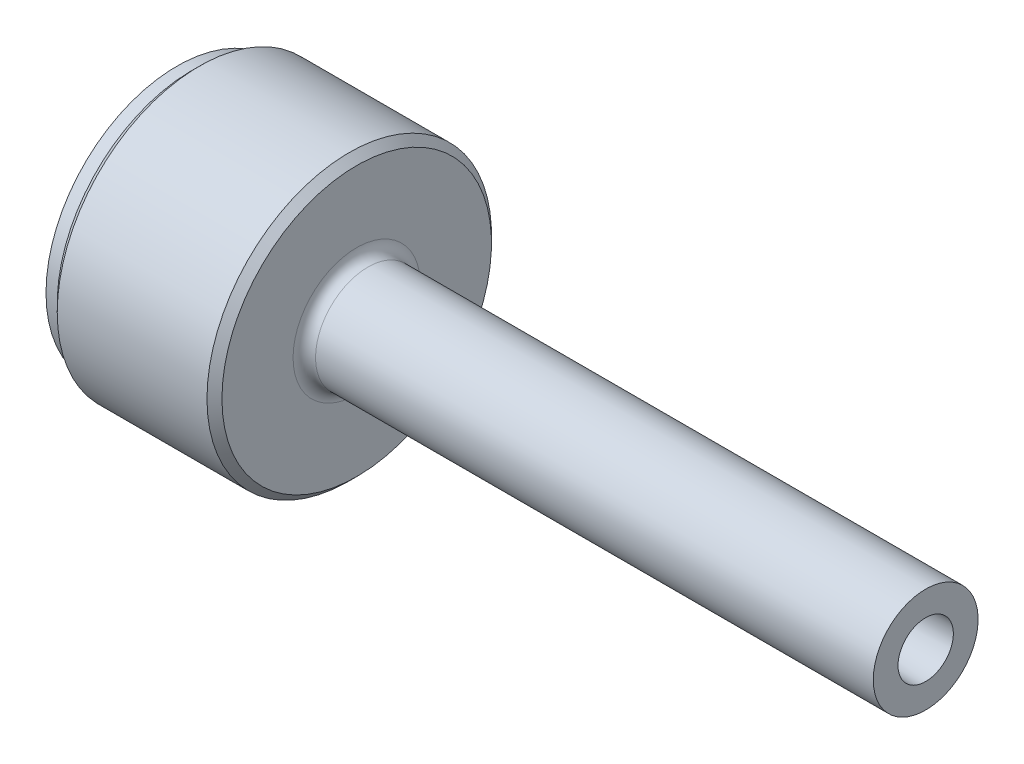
ISO-10303-21;
HEADER;
FILE_DESCRIPTION(('STEP AP214'),'2;1');
FILE_NAME('part.step','',(''),(''),'','','');
FILE_SCHEMA(('AUTOMOTIVE_DESIGN { 1 0 10303 214 1 1 1 1 }'));
ENDSEC;
DATA;
#1=APPLICATION_CONTEXT('core data for automotive mechanical design processes');
#2=APPLICATION_PROTOCOL_DEFINITION('international standard','automotive_design',2000,#1);
#3=PRODUCT_CONTEXT('',#1,'mechanical');
#4=PRODUCT('Part','Part','',(#3));
#5=PRODUCT_RELATED_PRODUCT_CATEGORY('part','',(#4));
#6=PRODUCT_DEFINITION_FORMATION('','',#4);
#7=PRODUCT_DEFINITION_CONTEXT('part definition',#1,'design');
#8=PRODUCT_DEFINITION('design','',#6,#7);
#9=PRODUCT_DEFINITION_SHAPE('','',#8);
#10=(LENGTH_UNIT() NAMED_UNIT(*) SI_UNIT(.MILLI.,.METRE.));
#11=(NAMED_UNIT(*) PLANE_ANGLE_UNIT() SI_UNIT($,.RADIAN.));
#12=(NAMED_UNIT(*) SI_UNIT($,.STERADIAN.) SOLID_ANGLE_UNIT());
#13=UNCERTAINTY_MEASURE_WITH_UNIT(LENGTH_MEASURE(1.E-05),#10,'distance_accuracy_value','');
#14=(GEOMETRIC_REPRESENTATION_CONTEXT(3) GLOBAL_UNCERTAINTY_ASSIGNED_CONTEXT((#13)) GLOBAL_UNIT_ASSIGNED_CONTEXT((#10,
#11,#12)) REPRESENTATION_CONTEXT('',''));
#15=CARTESIAN_POINT('',(0.,0.,0.));
#16=DIRECTION('',(0.,0.,1.));
#17=DIRECTION('',(1.,0.,0.));
#18=AXIS2_PLACEMENT_3D('',#15,#16,#17);
#19=CARTESIAN_POINT('',(100.,7.,0.));
#20=DIRECTION('',(-1.,0.,0.));
#21=DIRECTION('',(0.,0.,1.));
#22=AXIS2_PLACEMENT_3D('',#19,#20,#21);
#23=PLANE('',#22);
#24=CARTESIAN_POINT('',(100.,0.,0.));
#25=DIRECTION('',(-1.,0.,0.));
#26=DIRECTION('',(0.,0.,1.));
#27=AXIS2_PLACEMENT_3D('',#24,#25,#26);
#28=CIRCLE('',#27,7.);
#29=CARTESIAN_POINT('',(100.,0.,7.));
#30=VERTEX_POINT('',#29);
#31=EDGE_CURVE('E40',#30,#30,#28,.T.);
#32=ORIENTED_EDGE('',*,*,#31,.F.);
#33=EDGE_LOOP('',(#32));
#34=FACE_BOUND('',#33,.T.);
#35=CARTESIAN_POINT('',(100.,0.,0.));
#36=DIRECTION('',(-1.,0.,0.));
#37=DIRECTION('',(0.,0.,1.));
#38=AXIS2_PLACEMENT_3D('',#35,#36,#37);
#39=CIRCLE('',#38,3.69314129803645);
#40=CARTESIAN_POINT('',(100.,0.,3.69314129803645));
#41=VERTEX_POINT('',#40);
#42=EDGE_CURVE('E55',#41,#41,#39,.T.);
#43=ORIENTED_EDGE('',*,*,#42,.T.);
#44=EDGE_LOOP('',(#43));
#45=FACE_BOUND('',#44,.T.);
#46=ADVANCED_FACE('F14',(#34,#45),#23,.F.);
#47=CARTESIAN_POINT('',(0.,0.,0.));
#48=DIRECTION('',(-1.,0.,0.));
#49=DIRECTION('',(0.,0.,1.));
#50=AXIS2_PLACEMENT_3D('',#47,#48,#49);
#51=CYLINDRICAL_SURFACE('',#50,7.);
#52=CARTESIAN_POINT('',(25.5,0.,0.));
#53=DIRECTION('',(-1.,0.,0.));
#54=DIRECTION('',(0.,0.,1.));
#55=AXIS2_PLACEMENT_3D('',#52,#53,#54);
#56=CIRCLE('',#55,7.);
#57=CARTESIAN_POINT('',(25.5,0.,7.));
#58=VERTEX_POINT('',#57);
#59=EDGE_CURVE('E9',#58,#58,#56,.F.);
#60=ORIENTED_EDGE('',*,*,#59,.T.);
#61=EDGE_LOOP('',(#60));
#62=FACE_BOUND('',#61,.T.);
#63=ORIENTED_EDGE('',*,*,#31,.T.);
#64=EDGE_LOOP('',(#63));
#65=FACE_BOUND('',#64,.T.);
#66=ADVANCED_FACE('F99',(#62,#65),#51,.T.);
#67=CARTESIAN_POINT('',(24.,19.,0.));
#68=DIRECTION('',(-1.,0.,0.));
#69=DIRECTION('',(0.,0.,1.));
#70=AXIS2_PLACEMENT_3D('',#67,#68,#69);
#71=PLANE('',#70);
#72=CARTESIAN_POINT('',(24.,0.,0.));
#73=DIRECTION('',(-1.,0.,0.));
#74=DIRECTION('',(0.,0.,1.));
#75=AXIS2_PLACEMENT_3D('',#72,#73,#74);
#76=CIRCLE('',#75,8.5);
#77=CARTESIAN_POINT('',(24.,0.,8.5));
#78=VERTEX_POINT('',#77);
#79=EDGE_CURVE('E21',#78,#78,#76,.T.);
#80=ORIENTED_EDGE('',*,*,#79,.T.);
#81=EDGE_LOOP('',(#80));
#82=FACE_BOUND('',#81,.T.);
#83=CARTESIAN_POINT('',(24.,0.,0.));
#84=DIRECTION('',(-1.,0.,0.));
#85=DIRECTION('',(0.,0.,1.));
#86=AXIS2_PLACEMENT_3D('',#83,#84,#85);
#87=CIRCLE('',#86,18.);
#88=CARTESIAN_POINT('',(24.,0.,18.));
#89=VERTEX_POINT('',#88);
#90=EDGE_CURVE('E29',#89,#89,#87,.F.);
#91=ORIENTED_EDGE('',*,*,#90,.T.);
#92=EDGE_LOOP('',(#91));
#93=FACE_BOUND('',#92,.T.);
#94=ADVANCED_FACE('F95',(#82,#93),#71,.F.);
#95=CARTESIAN_POINT('',(0.,0.,0.));
#96=DIRECTION('',(-1.,0.,0.));
#97=DIRECTION('',(0.,0.,1.));
#98=AXIS2_PLACEMENT_3D('',#95,#96,#97);
#99=CYLINDRICAL_SURFACE('',#98,19.);
#100=CARTESIAN_POINT('',(23.,0.,0.));
#101=DIRECTION('',(-1.,0.,0.));
#102=DIRECTION('',(0.,0.,1.));
#103=AXIS2_PLACEMENT_3D('',#100,#101,#102);
#104=CIRCLE('',#103,19.);
#105=CARTESIAN_POINT('',(23.,0.,19.));
#106=VERTEX_POINT('',#105);
#107=EDGE_CURVE('E34',#106,#106,#104,.T.);
#108=ORIENTED_EDGE('',*,*,#107,.T.);
#109=EDGE_LOOP('',(#108));
#110=FACE_BOUND('',#109,.T.);
#111=CARTESIAN_POINT('',(3.,0.,0.));
#112=DIRECTION('',(1.,0.,0.));
#113=DIRECTION('',(0.,0.,-1.));
#114=AXIS2_PLACEMENT_3D('',#111,#112,#113);
#115=CIRCLE('',#114,19.);
#116=CARTESIAN_POINT('',(3.,0.,-19.));
#117=VERTEX_POINT('',#116);
#118=EDGE_CURVE('E37',#117,#117,#115,.T.);
#119=ORIENTED_EDGE('',*,*,#118,.T.);
#120=EDGE_LOOP('',(#119));
#121=FACE_BOUND('',#120,.T.);
#122=ADVANCED_FACE('F87',(#110,#121),#99,.T.);
#123=CARTESIAN_POINT('',(2.,17.5,0.));
#124=DIRECTION('',(1.,0.,0.));
#125=DIRECTION('',(0.,0.,-1.));
#126=AXIS2_PLACEMENT_3D('',#123,#124,#125);
#127=PLANE('',#126);
#128=CARTESIAN_POINT('',(2.,0.,0.));
#129=DIRECTION('',(1.,0.,0.));
#130=DIRECTION('',(0.,0.,-1.));
#131=AXIS2_PLACEMENT_3D('',#128,#129,#130);
#132=CIRCLE('',#131,18.);
#133=CARTESIAN_POINT('',(2.,0.,-18.));
#134=VERTEX_POINT('',#133);
#135=EDGE_CURVE('E25',#134,#134,#132,.F.);
#136=ORIENTED_EDGE('',*,*,#135,.T.);
#137=EDGE_LOOP('',(#136));
#138=FACE_BOUND('',#137,.T.);
#139=CARTESIAN_POINT('',(2.,0.,0.));
#140=DIRECTION('',(-1.,0.,0.));
#141=DIRECTION('',(0.,0.,1.));
#142=AXIS2_PLACEMENT_3D('',#139,#140,#141);
#143=CIRCLE('',#142,17.5);
#144=CARTESIAN_POINT('',(2.,0.,17.5));
#145=VERTEX_POINT('',#144);
#146=EDGE_CURVE('E43',#145,#145,#143,.T.);
#147=ORIENTED_EDGE('',*,*,#146,.F.);
#148=EDGE_LOOP('',(#147));
#149=FACE_BOUND('',#148,.T.);
#150=ADVANCED_FACE('F82',(#138,#149),#127,.F.);
#151=CARTESIAN_POINT('',(0.,0.,0.));
#152=DIRECTION('',(-1.,0.,0.));
#153=DIRECTION('',(0.,0.,1.));
#154=AXIS2_PLACEMENT_3D('',#151,#152,#153);
#155=CYLINDRICAL_SURFACE('',#154,17.5);
#156=CARTESIAN_POINT('',(0.,0.,0.));
#157=DIRECTION('',(-1.,0.,0.));
#158=DIRECTION('',(0.,0.,1.));
#159=AXIS2_PLACEMENT_3D('',#156,#157,#158);
#160=CIRCLE('',#159,17.5);
#161=CARTESIAN_POINT('',(0.,0.,17.5));
#162=VERTEX_POINT('',#161);
#163=EDGE_CURVE('E46',#162,#162,#160,.T.);
#164=ORIENTED_EDGE('',*,*,#163,.F.);
#165=EDGE_LOOP('',(#164));
#166=FACE_BOUND('',#165,.T.);
#167=ORIENTED_EDGE('',*,*,#146,.T.);
#168=EDGE_LOOP('',(#167));
#169=FACE_BOUND('',#168,.T.);
#170=ADVANCED_FACE('F76',(#166,#169),#155,.T.);
#171=CARTESIAN_POINT('',(0.,8.9624151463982,0.));
#172=DIRECTION('',(1.,0.,0.));
#173=DIRECTION('',(0.,0.,-1.));
#174=AXIS2_PLACEMENT_3D('',#171,#172,#173);
#175=PLANE('',#174);
#176=CARTESIAN_POINT('',(0.,0.,0.));
#177=DIRECTION('',(-1.,0.,0.));
#178=DIRECTION('',(0.,0.,1.));
#179=AXIS2_PLACEMENT_3D('',#176,#177,#178);
#180=CIRCLE('',#179,8.9624151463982);
#181=CARTESIAN_POINT('',(0.,0.,8.9624151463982));
#182=VERTEX_POINT('',#181);
#183=EDGE_CURVE('E49',#182,#182,#180,.T.);
#184=ORIENTED_EDGE('',*,*,#183,.F.);
#185=EDGE_LOOP('',(#184));
#186=FACE_BOUND('',#185,.T.);
#187=ORIENTED_EDGE('',*,*,#163,.T.);
#188=EDGE_LOOP('',(#187));
#189=FACE_BOUND('',#188,.T.);
#190=ADVANCED_FACE('F70',(#186,#189),#175,.F.);
#191=CARTESIAN_POINT('',(-11.8284890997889,0.,0.));
#192=DIRECTION('',(-1.,0.,0.));
#193=DIRECTION('',(0.,0.,1.));
#194=AXIS2_PLACEMENT_3D('',#191,#192,#193);
#195=DEGENERATE_TOROIDAL_SURFACE('',#194,0.261837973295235,15.,.F.);
#196=CARTESIAN_POINT('',(3.,0.,0.));
#197=DIRECTION('',(-1.,0.,0.));
#198=DIRECTION('',(0.,0.,1.));
#199=AXIS2_PLACEMENT_3D('',#196,#197,#198);
#200=CIRCLE('',#199,2.);
#201=CARTESIAN_POINT('',(3.,0.,2.));
#202=VERTEX_POINT('',#201);
#203=EDGE_CURVE('E52',#202,#202,#200,.T.);
#204=ORIENTED_EDGE('',*,*,#203,.F.);
#205=EDGE_LOOP('',(#204));
#206=FACE_BOUND('',#205,.T.);
#207=ORIENTED_EDGE('',*,*,#183,.T.);
#208=EDGE_LOOP('',(#207));
#209=FACE_BOUND('',#208,.T.);
#210=ADVANCED_FACE('F64',(#206,#209),#195,.T.);
#211=CARTESIAN_POINT('',(3.,0.,0.));
#212=DIRECTION('',(1.,0.,0.));
#213=DIRECTION('',(0.,0.,-1.));
#214=AXIS2_PLACEMENT_3D('',#211,#212,#213);
#215=CONICAL_SURFACE('',#214,2.,0.0174532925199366);
#216=ORIENTED_EDGE('',*,*,#42,.F.);
#217=EDGE_LOOP('',(#216));
#218=FACE_BOUND('',#217,.T.);
#219=ORIENTED_EDGE('',*,*,#203,.T.);
#220=EDGE_LOOP('',(#219));
#221=FACE_BOUND('',#220,.T.);
#222=ADVANCED_FACE('F60',(#218,#221),#215,.F.);
#223=CARTESIAN_POINT('',(23.,0.,0.));
#224=DIRECTION('',(-1.,0.,0.));
#225=DIRECTION('',(0.,0.,1.));
#226=AXIS2_PLACEMENT_3D('',#223,#224,#225);
#227=CONICAL_SURFACE('',#226,19.,0.78539816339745);
#228=ORIENTED_EDGE('',*,*,#90,.F.);
#229=EDGE_LOOP('',(#228));
#230=FACE_BOUND('',#229,.T.);
#231=ORIENTED_EDGE('',*,*,#107,.F.);
#232=EDGE_LOOP('',(#231));
#233=FACE_BOUND('',#232,.T.);
#234=ADVANCED_FACE('F63',(#230,#233),#227,.T.);
#235=CARTESIAN_POINT('',(2.,0.,0.));
#236=DIRECTION('',(1.,0.,0.));
#237=DIRECTION('',(0.,0.,-1.));
#238=AXIS2_PLACEMENT_3D('',#235,#236,#237);
#239=CONICAL_SURFACE('',#238,18.,0.78539816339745);
#240=ORIENTED_EDGE('',*,*,#118,.F.);
#241=EDGE_LOOP('',(#240));
#242=FACE_BOUND('',#241,.T.);
#243=ORIENTED_EDGE('',*,*,#135,.F.);
#244=EDGE_LOOP('',(#243));
#245=FACE_BOUND('',#244,.T.);
#246=ADVANCED_FACE('F111',(#242,#245),#239,.T.);
#247=CARTESIAN_POINT('',(25.5,0.,0.));
#248=DIRECTION('',(-1.,0.,0.));
#249=DIRECTION('',(0.,0.,1.));
#250=AXIS2_PLACEMENT_3D('',#247,#248,#249);
#251=TOROIDAL_SURFACE('',#250,8.5,1.5);
#252=ORIENTED_EDGE('',*,*,#59,.F.);
#253=EDGE_LOOP('',(#252));
#254=FACE_BOUND('',#253,.T.);
#255=ORIENTED_EDGE('',*,*,#79,.F.);
#256=EDGE_LOOP('',(#255));
#257=FACE_BOUND('',#256,.T.);
#258=ADVANCED_FACE('F16',(#254,#257),#251,.F.);
#259=CLOSED_SHELL('',(#46,#66,#94,#122,#150,#170,#190,#210,#222,#234,#246,#258));
#260=MANIFOLD_SOLID_BREP('B1',#259);
#261=ADVANCED_BREP_SHAPE_REPRESENTATION('',(#18,#260),#14);
#262=SHAPE_DEFINITION_REPRESENTATION(#9,#261);
ENDSEC;
END-ISO-10303-21;
